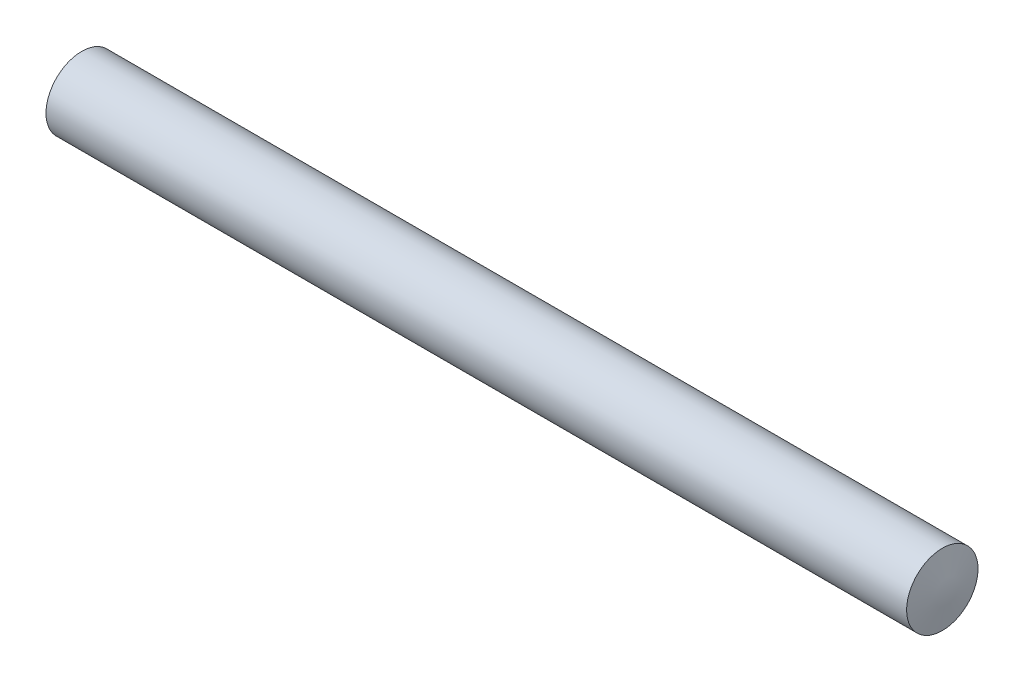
from build123d import *


with BuildPart() as part:
    # Sketch2 → Revolve1 (revolve)
    with BuildSketch(Plane.XY, mode=Mode.PRIVATE) as revolve1_sk:
        Polygon((0, -24.13), (15.309272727, -24.13), (15.528636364, -25.4), (0, -25.4), align=None)
    revolve(revolve1_sk.sketch.rotate(Axis((15.528636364, -25.4, 0), (-1, 0, 0)), 270), axis=Axis((15.528636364, -25.4, 0), (-1, 0, 0)))

    # Mirror1: part across plane


with BuildPart() as part_1:
    add(part.part)
    add(part.part.mirror(Plane(origin=(0, 0, 0), x_dir=(0, 0, 1), z_dir=(1, 0, 0))))


solid = part_1.part
